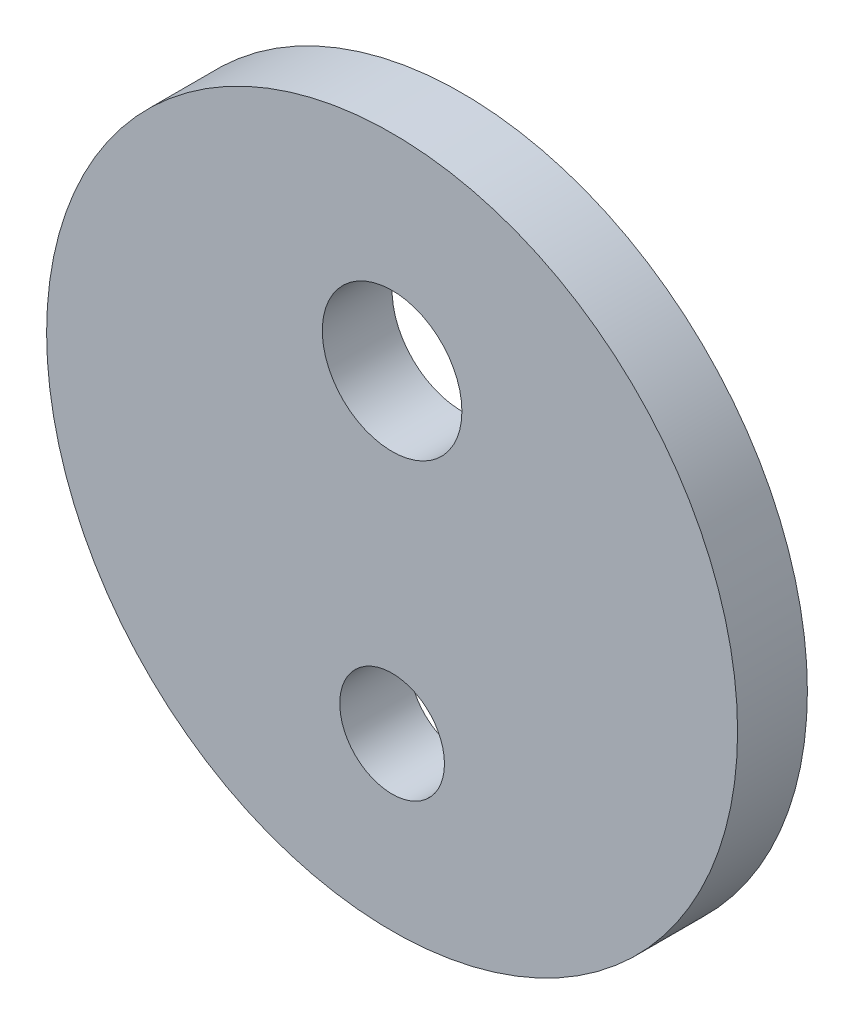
ISO-10303-21;
HEADER;
FILE_DESCRIPTION(('STEP AP214'),'2;1');
FILE_NAME('part.step','',(''),(''),'','','');
FILE_SCHEMA(('AUTOMOTIVE_DESIGN { 1 0 10303 214 1 1 1 1 }'));
ENDSEC;
DATA;
#1=APPLICATION_CONTEXT('core data for automotive mechanical design processes');
#2=APPLICATION_PROTOCOL_DEFINITION('international standard','automotive_design',2000,#1);
#3=PRODUCT_CONTEXT('',#1,'mechanical');
#4=PRODUCT('Part','Part','',(#3));
#5=PRODUCT_RELATED_PRODUCT_CATEGORY('part','',(#4));
#6=PRODUCT_DEFINITION_FORMATION('','',#4);
#7=PRODUCT_DEFINITION_CONTEXT('part definition',#1,'design');
#8=PRODUCT_DEFINITION('design','',#6,#7);
#9=PRODUCT_DEFINITION_SHAPE('','',#8);
#10=(LENGTH_UNIT() NAMED_UNIT(*) SI_UNIT(.MILLI.,.METRE.));
#11=(NAMED_UNIT(*) PLANE_ANGLE_UNIT() SI_UNIT($,.RADIAN.));
#12=(NAMED_UNIT(*) SI_UNIT($,.STERADIAN.) SOLID_ANGLE_UNIT());
#13=UNCERTAINTY_MEASURE_WITH_UNIT(LENGTH_MEASURE(1.E-05),#10,'distance_accuracy_value','');
#14=(GEOMETRIC_REPRESENTATION_CONTEXT(3) GLOBAL_UNCERTAINTY_ASSIGNED_CONTEXT((#13)) GLOBAL_UNIT_ASSIGNED_CONTEXT((#10,
#11,#12)) REPRESENTATION_CONTEXT('',''));
#15=CARTESIAN_POINT('',(0.,0.,0.));
#16=DIRECTION('',(0.,0.,1.));
#17=DIRECTION('',(1.,0.,0.));
#18=AXIS2_PLACEMENT_3D('',#15,#16,#17);
#19=CARTESIAN_POINT('',(0.,0.,10.));
#20=DIRECTION('',(0.,0.,1.));
#21=DIRECTION('',(1.,0.,0.));
#22=AXIS2_PLACEMENT_3D('',#19,#20,#21);
#23=PLANE('',#22);
#24=CARTESIAN_POINT('',(0.,20.,10.));
#25=DIRECTION('',(0.,0.,1.));
#26=DIRECTION('',(1.,0.,0.));
#27=AXIS2_PLACEMENT_3D('',#24,#25,#26);
#28=CIRCLE('',#27,10.);
#29=CARTESIAN_POINT('',(10.,20.,10.));
#30=VERTEX_POINT('',#29);
#31=EDGE_CURVE('E40',#30,#30,#28,.T.);
#32=ORIENTED_EDGE('',*,*,#31,.F.);
#33=EDGE_LOOP('',(#32));
#34=FACE_BOUND('',#33,.T.);
#35=CARTESIAN_POINT('',(0.,0.,10.));
#36=DIRECTION('',(0.,0.,1.));
#37=DIRECTION('',(1.,0.,0.));
#38=AXIS2_PLACEMENT_3D('',#35,#36,#37);
#39=CIRCLE('',#38,49.4974746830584);
#40=CARTESIAN_POINT('',(49.4974746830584,0.,10.));
#41=VERTEX_POINT('',#40);
#42=EDGE_CURVE('E10',#41,#41,#39,.T.);
#43=ORIENTED_EDGE('',*,*,#42,.T.);
#44=EDGE_LOOP('',(#43));
#45=FACE_BOUND('',#44,.T.);
#46=CARTESIAN_POINT('',(0.,-25.,10.));
#47=DIRECTION('',(0.,0.,1.));
#48=DIRECTION('',(1.,0.,0.));
#49=AXIS2_PLACEMENT_3D('',#46,#47,#48);
#50=CIRCLE('',#49,7.5);
#51=CARTESIAN_POINT('',(7.5,-25.,10.));
#52=VERTEX_POINT('',#51);
#53=EDGE_CURVE('E49',#52,#52,#50,.T.);
#54=ORIENTED_EDGE('',*,*,#53,.F.);
#55=EDGE_LOOP('',(#54));
#56=FACE_BOUND('',#55,.T.);
#57=ADVANCED_FACE('F29',(#34,#45,#56),#23,.T.);
#58=CARTESIAN_POINT('',(0.,0.,0.));
#59=DIRECTION('',(0.,0.,1.));
#60=DIRECTION('',(1.,0.,0.));
#61=AXIS2_PLACEMENT_3D('',#58,#59,#60);
#62=PLANE('',#61);
#63=CARTESIAN_POINT('',(0.,20.,0.));
#64=DIRECTION('',(0.,0.,1.));
#65=DIRECTION('',(1.,0.,0.));
#66=AXIS2_PLACEMENT_3D('',#63,#64,#65);
#67=CIRCLE('',#66,10.);
#68=CARTESIAN_POINT('',(10.,20.,0.));
#69=VERTEX_POINT('',#68);
#70=EDGE_CURVE('E44',#69,#69,#67,.T.);
#71=ORIENTED_EDGE('',*,*,#70,.T.);
#72=EDGE_LOOP('',(#71));
#73=FACE_BOUND('',#72,.T.);
#74=CARTESIAN_POINT('',(0.,0.,0.));
#75=DIRECTION('',(0.,0.,1.));
#76=DIRECTION('',(1.,0.,0.));
#77=AXIS2_PLACEMENT_3D('',#74,#75,#76);
#78=CIRCLE('',#77,49.4974746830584);
#79=CARTESIAN_POINT('',(49.4974746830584,0.,0.));
#80=VERTEX_POINT('',#79);
#81=EDGE_CURVE('E36',#80,#80,#78,.T.);
#82=ORIENTED_EDGE('',*,*,#81,.F.);
#83=EDGE_LOOP('',(#82));
#84=FACE_BOUND('',#83,.T.);
#85=CARTESIAN_POINT('',(0.,-25.,0.));
#86=DIRECTION('',(0.,0.,1.));
#87=DIRECTION('',(1.,0.,0.));
#88=AXIS2_PLACEMENT_3D('',#85,#86,#87);
#89=CIRCLE('',#88,7.5);
#90=CARTESIAN_POINT('',(7.5,-25.,0.));
#91=VERTEX_POINT('',#90);
#92=EDGE_CURVE('E52',#91,#91,#89,.T.);
#93=ORIENTED_EDGE('',*,*,#92,.T.);
#94=EDGE_LOOP('',(#93));
#95=FACE_BOUND('',#94,.T.);
#96=ADVANCED_FACE('F56',(#73,#84,#95),#62,.F.);
#97=CARTESIAN_POINT('',(0.,0.,10.));
#98=DIRECTION('',(0.,0.,-1.));
#99=DIRECTION('',(-1.,0.,0.));
#100=AXIS2_PLACEMENT_3D('',#97,#98,#99);
#101=CYLINDRICAL_SURFACE('',#100,49.4974746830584);
#102=ORIENTED_EDGE('',*,*,#42,.F.);
#103=EDGE_LOOP('',(#102));
#104=FACE_BOUND('',#103,.T.);
#105=ORIENTED_EDGE('',*,*,#81,.T.);
#106=EDGE_LOOP('',(#105));
#107=FACE_BOUND('',#106,.T.);
#108=ADVANCED_FACE('F31',(#104,#107),#101,.T.);
#109=CARTESIAN_POINT('',(0.,20.,10.));
#110=DIRECTION('',(0.,0.,-1.));
#111=DIRECTION('',(-1.,0.,0.));
#112=AXIS2_PLACEMENT_3D('',#109,#110,#111);
#113=CYLINDRICAL_SURFACE('',#112,10.);
#114=ORIENTED_EDGE('',*,*,#31,.T.);
#115=EDGE_LOOP('',(#114));
#116=FACE_BOUND('',#115,.T.);
#117=ORIENTED_EDGE('',*,*,#70,.F.);
#118=EDGE_LOOP('',(#117));
#119=FACE_BOUND('',#118,.T.);
#120=ADVANCED_FACE('F60',(#116,#119),#113,.F.);
#121=CARTESIAN_POINT('',(0.,-25.,10.));
#122=DIRECTION('',(0.,0.,-1.));
#123=DIRECTION('',(-1.,0.,0.));
#124=AXIS2_PLACEMENT_3D('',#121,#122,#123);
#125=CYLINDRICAL_SURFACE('',#124,7.5);
#126=ORIENTED_EDGE('',*,*,#53,.T.);
#127=EDGE_LOOP('',(#126));
#128=FACE_BOUND('',#127,.T.);
#129=ORIENTED_EDGE('',*,*,#92,.F.);
#130=EDGE_LOOP('',(#129));
#131=FACE_BOUND('',#130,.T.);
#132=ADVANCED_FACE('F58',(#128,#131),#125,.F.);
#133=CLOSED_SHELL('',(#57,#96,#108,#120,#132));
#134=MANIFOLD_SOLID_BREP('B2',#133);
#135=ADVANCED_BREP_SHAPE_REPRESENTATION('',(#18,#134),#14);
#136=SHAPE_DEFINITION_REPRESENTATION(#9,#135);
ENDSEC;
END-ISO-10303-21;
